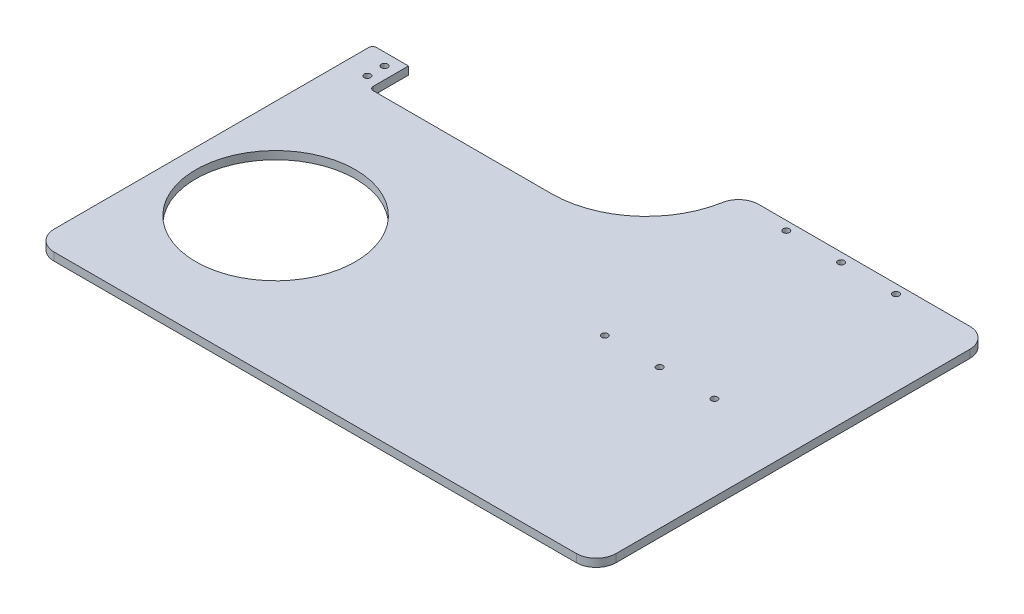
ISO-10303-21;
HEADER;
FILE_DESCRIPTION(('STEP AP214'),'2;1');
FILE_NAME('part.step','',(''),(''),'','','');
FILE_SCHEMA(('AUTOMOTIVE_DESIGN { 1 0 10303 214 1 1 1 1 }'));
ENDSEC;
DATA;
#1=APPLICATION_CONTEXT('core data for automotive mechanical design processes');
#2=APPLICATION_PROTOCOL_DEFINITION('international standard','automotive_design',2000,#1);
#3=PRODUCT_CONTEXT('',#1,'mechanical');
#4=PRODUCT('Part','Part','',(#3));
#5=PRODUCT_RELATED_PRODUCT_CATEGORY('part','',(#4));
#6=PRODUCT_DEFINITION_FORMATION('','',#4);
#7=PRODUCT_DEFINITION_CONTEXT('part definition',#1,'design');
#8=PRODUCT_DEFINITION('design','',#6,#7);
#9=PRODUCT_DEFINITION_SHAPE('','',#8);
#10=(LENGTH_UNIT() NAMED_UNIT(*) SI_UNIT(.MILLI.,.METRE.));
#11=(NAMED_UNIT(*) PLANE_ANGLE_UNIT() SI_UNIT($,.RADIAN.));
#12=(NAMED_UNIT(*) SI_UNIT($,.STERADIAN.) SOLID_ANGLE_UNIT());
#13=UNCERTAINTY_MEASURE_WITH_UNIT(LENGTH_MEASURE(1.E-05),#10,'distance_accuracy_value','');
#14=(GEOMETRIC_REPRESENTATION_CONTEXT(3) GLOBAL_UNCERTAINTY_ASSIGNED_CONTEXT((#13)) GLOBAL_UNIT_ASSIGNED_CONTEXT((#10,
#11,#12)) REPRESENTATION_CONTEXT('',''));
#15=CARTESIAN_POINT('',(0.,0.,0.));
#16=DIRECTION('',(0.,0.,1.));
#17=DIRECTION('',(1.,0.,0.));
#18=AXIS2_PLACEMENT_3D('',#15,#16,#17);
#19=CARTESIAN_POINT('',(0.,0.,0.));
#20=DIRECTION('',(0.,-1.,0.));
#21=DIRECTION('',(0.,0.,-1.));
#22=AXIS2_PLACEMENT_3D('',#19,#20,#21);
#23=PLANE('',#22);
#24=CARTESIAN_POINT('',(0.896230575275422,0.,-14.));
#25=DIRECTION('',(0.,-1.,0.));
#26=DIRECTION('',(0.,0.,-1.));
#27=AXIS2_PLACEMENT_3D('',#24,#25,#26);
#28=CIRCLE('',#27,40.);
#29=CARTESIAN_POINT('',(0.896230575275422,0.,-54.));
#30=VERTEX_POINT('',#29);
#31=EDGE_CURVE('E365',#30,#30,#28,.F.);
#32=ORIENTED_EDGE('',*,*,#31,.T.);
#33=EDGE_LOOP('',(#32));
#34=FACE_BOUND('',#33,.T.);
#35=CARTESIAN_POINT('',(135.415383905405,0.,-44.5));
#36=DIRECTION('',(0.,-1.,0.));
#37=DIRECTION('',(0.,0.,-1.));
#38=AXIS2_PLACEMENT_3D('',#35,#36,#37);
#39=CIRCLE('',#38,1.59999999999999);
#40=CARTESIAN_POINT('',(135.415383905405,0.,-46.1));
#41=VERTEX_POINT('',#40);
#42=EDGE_CURVE('E369',#41,#41,#39,.F.);
#43=ORIENTED_EDGE('',*,*,#42,.T.);
#44=EDGE_LOOP('',(#43));
#45=FACE_BOUND('',#44,.T.);
#46=CARTESIAN_POINT('',(162.915383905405,0.,-44.5));
#47=DIRECTION('',(0.,-1.,0.));
#48=DIRECTION('',(0.,0.,-1.));
#49=AXIS2_PLACEMENT_3D('',#46,#47,#48);
#50=CIRCLE('',#49,1.59999999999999);
#51=CARTESIAN_POINT('',(162.915383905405,0.,-46.1));
#52=VERTEX_POINT('',#51);
#53=EDGE_CURVE('E373',#52,#52,#50,.F.);
#54=ORIENTED_EDGE('',*,*,#53,.T.);
#55=EDGE_LOOP('',(#54));
#56=FACE_BOUND('',#55,.T.);
#57=CARTESIAN_POINT('',(190.415383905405,0.,-44.5));
#58=DIRECTION('',(0.,-1.,0.));
#59=DIRECTION('',(0.,0.,-1.));
#60=AXIS2_PLACEMENT_3D('',#57,#58,#59);
#61=CIRCLE('',#60,1.59999999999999);
#62=CARTESIAN_POINT('',(190.415383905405,0.,-46.1));
#63=VERTEX_POINT('',#62);
#64=EDGE_CURVE('E377',#63,#63,#61,.F.);
#65=ORIENTED_EDGE('',*,*,#64,.T.);
#66=EDGE_LOOP('',(#65));
#67=FACE_BOUND('',#66,.T.);
#68=CARTESIAN_POINT('',(190.415383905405,0.,-135.5));
#69=DIRECTION('',(0.,-1.,0.));
#70=DIRECTION('',(0.,0.,-1.));
#71=AXIS2_PLACEMENT_3D('',#68,#69,#70);
#72=CIRCLE('',#71,1.59999999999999);
#73=CARTESIAN_POINT('',(190.415383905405,0.,-137.1));
#74=VERTEX_POINT('',#73);
#75=EDGE_CURVE('E381',#74,#74,#72,.F.);
#76=ORIENTED_EDGE('',*,*,#75,.T.);
#77=EDGE_LOOP('',(#76));
#78=FACE_BOUND('',#77,.T.);
#79=CARTESIAN_POINT('',(162.915383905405,0.,-135.5));
#80=DIRECTION('',(0.,-1.,0.));
#81=DIRECTION('',(0.,0.,-1.));
#82=AXIS2_PLACEMENT_3D('',#79,#80,#81);
#83=CIRCLE('',#82,1.59999999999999);
#84=CARTESIAN_POINT('',(162.915383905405,0.,-137.1));
#85=VERTEX_POINT('',#84);
#86=EDGE_CURVE('E385',#85,#85,#83,.F.);
#87=ORIENTED_EDGE('',*,*,#86,.T.);
#88=EDGE_LOOP('',(#87));
#89=FACE_BOUND('',#88,.T.);
#90=CARTESIAN_POINT('',(135.415383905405,0.,-135.5));
#91=DIRECTION('',(0.,-1.,0.));
#92=DIRECTION('',(0.,0.,-1.));
#93=AXIS2_PLACEMENT_3D('',#90,#91,#92);
#94=CIRCLE('',#93,1.59999999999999);
#95=CARTESIAN_POINT('',(135.415383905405,0.,-137.1));
#96=VERTEX_POINT('',#95);
#97=EDGE_CURVE('E389',#96,#96,#94,.F.);
#98=ORIENTED_EDGE('',*,*,#97,.T.);
#99=EDGE_LOOP('',(#98));
#100=FACE_BOUND('',#99,.T.);
#101=CARTESIAN_POINT('',(-36.8037694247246,0.,-97.7206100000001));
#102=DIRECTION('',(0.,-1.,0.));
#103=DIRECTION('',(0.,0.,-1.));
#104=AXIS2_PLACEMENT_3D('',#101,#102,#103);
#105=CIRCLE('',#104,1.6);
#106=CARTESIAN_POINT('',(-36.8037694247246,0.,-99.3206100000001));
#107=VERTEX_POINT('',#106);
#108=EDGE_CURVE('E393',#107,#107,#105,.F.);
#109=ORIENTED_EDGE('',*,*,#108,.T.);
#110=EDGE_LOOP('',(#109));
#111=FACE_BOUND('',#110,.T.);
#112=CARTESIAN_POINT('',(-36.8037694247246,0.,-106.32061));
#113=DIRECTION('',(0.,-1.,0.));
#114=DIRECTION('',(0.,0.,-1.));
#115=AXIS2_PLACEMENT_3D('',#112,#113,#114);
#116=CIRCLE('',#115,1.6);
#117=CARTESIAN_POINT('',(-36.8037694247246,0.,-107.92061));
#118=VERTEX_POINT('',#117);
#119=EDGE_CURVE('E208',#118,#118,#116,.F.);
#120=ORIENTED_EDGE('',*,*,#119,.T.);
#121=EDGE_LOOP('',(#120));
#122=FACE_BOUND('',#121,.T.);
#123=CARTESIAN_POINT('',(-38.8037694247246,0.,47.2949));
#124=DIRECTION('',(0.,-1.,0.));
#125=DIRECTION('',(0.,0.,-1.));
#126=AXIS2_PLACEMENT_3D('',#123,#124,#125);
#127=CIRCLE('',#126,10.);
#128=CARTESIAN_POINT('',(-38.8037694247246,0.,57.2949));
#129=VERTEX_POINT('',#128);
#130=CARTESIAN_POINT('',(-48.8037694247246,0.,47.2949));
#131=VERTEX_POINT('',#130);
#132=EDGE_CURVE('E109',#129,#131,#127,.T.);
#133=ORIENTED_EDGE('',*,*,#132,.T.);
#134=DIRECTION('',(0.,0.,-1.));
#135=VECTOR('',#134,1.);
#136=CARTESIAN_POINT('',(-48.8037694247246,0.,47.2949));
#137=LINE('',#136,#135);
#138=CARTESIAN_POINT('',(-48.8037694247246,0.,-110.32061));
#139=VERTEX_POINT('',#138);
#140=EDGE_CURVE('E192',#131,#139,#137,.T.);
#141=ORIENTED_EDGE('',*,*,#140,.T.);
#142=CARTESIAN_POINT('',(-46.8037694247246,0.,-110.32061));
#143=DIRECTION('',(0.,1.,0.));
#144=DIRECTION('',(0.,0.,1.));
#145=AXIS2_PLACEMENT_3D('',#142,#143,#144);
#146=CIRCLE('',#145,2.);
#147=CARTESIAN_POINT('',(-46.8037694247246,0.,-112.32061));
#148=VERTEX_POINT('',#147);
#149=EDGE_CURVE('E197',#148,#139,#146,.T.);
#150=ORIENTED_EDGE('',*,*,#149,.F.);
#151=DIRECTION('',(1.,0.,0.));
#152=VECTOR('',#151,1.);
#153=CARTESIAN_POINT('',(-46.8037694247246,0.,-112.32061));
#154=LINE('',#153,#152);
#155=CARTESIAN_POINT('',(-30.8037694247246,0.,-112.32061));
#156=VERTEX_POINT('',#155);
#157=EDGE_CURVE('E212',#148,#156,#154,.T.);
#158=ORIENTED_EDGE('',*,*,#157,.T.);
#159=DIRECTION('',(0.,0.,1.));
#160=VECTOR('',#159,1.);
#161=CARTESIAN_POINT('',(-30.8037694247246,0.,-112.32061));
#162=LINE('',#161,#160);
#163=CARTESIAN_POINT('',(-30.8037694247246,0.,-94.7051));
#164=VERTEX_POINT('',#163);
#165=EDGE_CURVE('E215',#156,#164,#162,.T.);
#166=ORIENTED_EDGE('',*,*,#165,.T.);
#167=CARTESIAN_POINT('',(-28.8037694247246,0.,-94.7051));
#168=DIRECTION('',(0.,1.,0.));
#169=DIRECTION('',(0.,0.,1.));
#170=AXIS2_PLACEMENT_3D('',#167,#168,#169);
#171=CIRCLE('',#170,2.);
#172=CARTESIAN_POINT('',(-28.8037694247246,0.,-92.7051));
#173=VERTEX_POINT('',#172);
#174=EDGE_CURVE('E218',#164,#173,#171,.T.);
#175=ORIENTED_EDGE('',*,*,#174,.T.);
#176=DIRECTION('',(1.,0.,0.));
#177=VECTOR('',#176,1.);
#178=CARTESIAN_POINT('',(-28.8037694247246,0.,-92.7051));
#179=LINE('',#178,#177);
#180=CARTESIAN_POINT('',(60.6204839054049,0.,-92.7051));
#181=VERTEX_POINT('',#180);
#182=EDGE_CURVE('E221',#173,#181,#179,.T.);
#183=ORIENTED_EDGE('',*,*,#182,.T.);
#184=CARTESIAN_POINT('',(60.6204839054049,0.,-140.));
#185=DIRECTION('',(0.,1.,0.));
#186=DIRECTION('',(0.,0.,1.));
#187=AXIS2_PLACEMENT_3D('',#184,#185,#186);
#188=CIRCLE('',#187,47.2949);
#189=CARTESIAN_POINT('',(107.189448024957,0.,-131.745356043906));
#190=VERTEX_POINT('',#189);
#191=EDGE_CURVE('E224',#181,#190,#188,.T.);
#192=ORIENTED_EDGE('',*,*,#191,.T.);
#193=CARTESIAN_POINT('',(117.035956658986,0.,-130.));
#194=DIRECTION('',(0.,-1.,0.));
#195=DIRECTION('',(0.,0.,-1.));
#196=AXIS2_PLACEMENT_3D('',#193,#194,#195);
#197=CIRCLE('',#196,10.);
#198=CARTESIAN_POINT('',(117.035956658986,0.,-140.));
#199=VERTEX_POINT('',#198);
#200=EDGE_CURVE('E227',#190,#199,#197,.T.);
#201=ORIENTED_EDGE('',*,*,#200,.T.);
#202=DIRECTION('',(1.,0.,0.));
#203=VECTOR('',#202,1.);
#204=CARTESIAN_POINT('',(117.035956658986,0.,-140.));
#205=LINE('',#204,#203);
#206=CARTESIAN_POINT('',(222.915383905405,0.,-140.));
#207=VERTEX_POINT('',#206);
#208=EDGE_CURVE('E230',#199,#207,#205,.T.);
#209=ORIENTED_EDGE('',*,*,#208,.T.);
#210=CARTESIAN_POINT('',(222.915383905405,0.,-130.));
#211=DIRECTION('',(0.,-1.,0.));
#212=DIRECTION('',(0.,0.,-1.));
#213=AXIS2_PLACEMENT_3D('',#210,#211,#212);
#214=CIRCLE('',#213,10.);
#215=CARTESIAN_POINT('',(232.915383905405,0.,-130.));
#216=VERTEX_POINT('',#215);
#217=EDGE_CURVE('E233',#207,#216,#214,.T.);
#218=ORIENTED_EDGE('',*,*,#217,.T.);
#219=DIRECTION('',(0.,0.,1.));
#220=VECTOR('',#219,1.);
#221=CARTESIAN_POINT('',(232.915383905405,0.,-130.));
#222=LINE('',#221,#220);
#223=CARTESIAN_POINT('',(232.915383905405,0.,47.2949));
#224=VERTEX_POINT('',#223);
#225=EDGE_CURVE('E236',#216,#224,#222,.T.);
#226=ORIENTED_EDGE('',*,*,#225,.T.);
#227=CARTESIAN_POINT('',(222.915383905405,0.,47.2949));
#228=DIRECTION('',(0.,-1.,0.));
#229=DIRECTION('',(0.,0.,-1.));
#230=AXIS2_PLACEMENT_3D('',#227,#228,#229);
#231=CIRCLE('',#230,10.);
#232=CARTESIAN_POINT('',(222.915383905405,0.,57.2949));
#233=VERTEX_POINT('',#232);
#234=EDGE_CURVE('E239',#224,#233,#231,.T.);
#235=ORIENTED_EDGE('',*,*,#234,.T.);
#236=DIRECTION('',(-1.,0.,0.));
#237=VECTOR('',#236,1.);
#238=CARTESIAN_POINT('',(222.915383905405,0.,57.2949));
#239=LINE('',#238,#237);
#240=EDGE_CURVE('E202',#233,#129,#239,.T.);
#241=ORIENTED_EDGE('',*,*,#240,.T.);
#242=EDGE_LOOP('',(#133,#141,#150,#158,#166,#175,#183,#192,#201,#209,#218,#226,#235,#241));
#243=FACE_BOUND('',#242,.T.);
#244=ADVANCED_FACE('F87',(#34,#45,#56,#67,#78,#89,#100,#111,#122,#243),#23,.T.);
#245=CARTESIAN_POINT('',(-38.8037694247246,0.,47.2949));
#246=DIRECTION('',(0.,1.,0.));
#247=DIRECTION('',(0.,0.,1.));
#248=AXIS2_PLACEMENT_3D('',#245,#246,#247);
#249=CYLINDRICAL_SURFACE('',#248,10.);
#250=CARTESIAN_POINT('',(-38.8037694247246,4.,47.2949));
#251=DIRECTION('',(0.,-1.,0.));
#252=DIRECTION('',(0.,0.,-1.));
#253=AXIS2_PLACEMENT_3D('',#250,#251,#252);
#254=CIRCLE('',#253,10.);
#255=CARTESIAN_POINT('',(-38.8037694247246,4.,57.2949));
#256=VERTEX_POINT('',#255);
#257=CARTESIAN_POINT('',(-48.8037694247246,4.,47.2949));
#258=VERTEX_POINT('',#257);
#259=EDGE_CURVE('E187',#256,#258,#254,.T.);
#260=ORIENTED_EDGE('',*,*,#259,.T.);
#261=DIRECTION('',(0.,1.,0.));
#262=VECTOR('',#261,1.);
#263=CARTESIAN_POINT('',(-48.8037694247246,0.,47.2949));
#264=LINE('',#263,#262);
#265=EDGE_CURVE('E12',#131,#258,#264,.T.);
#266=ORIENTED_EDGE('',*,*,#265,.F.);
#267=ORIENTED_EDGE('',*,*,#132,.F.);
#268=DIRECTION('',(0.,1.,0.));
#269=VECTOR('',#268,1.);
#270=CARTESIAN_POINT('',(-38.8037694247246,0.,57.2949));
#271=LINE('',#270,#269);
#272=EDGE_CURVE('E242',#129,#256,#271,.T.);
#273=ORIENTED_EDGE('',*,*,#272,.T.);
#274=EDGE_LOOP('',(#260,#266,#267,#273));
#275=FACE_BOUND('',#274,.T.);
#276=ADVANCED_FACE('F185',(#275),#249,.T.);
#277=CARTESIAN_POINT('',(-48.8037694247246,0.,47.2949));
#278=DIRECTION('',(1.,0.,0.));
#279=DIRECTION('',(0.,0.,-1.));
#280=AXIS2_PLACEMENT_3D('',#277,#278,#279);
#281=PLANE('',#280);
#282=DIRECTION('',(0.,0.,-1.));
#283=VECTOR('',#282,1.);
#284=CARTESIAN_POINT('',(-48.8037694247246,4.,47.2949));
#285=LINE('',#284,#283);
#286=CARTESIAN_POINT('',(-48.8037694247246,4.,-110.32061));
#287=VERTEX_POINT('',#286);
#288=EDGE_CURVE('E244',#258,#287,#285,.T.);
#289=ORIENTED_EDGE('',*,*,#288,.T.);
#290=DIRECTION('',(0.,1.,0.));
#291=VECTOR('',#290,1.);
#292=CARTESIAN_POINT('',(-48.8037694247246,0.,-110.32061));
#293=LINE('',#292,#291);
#294=EDGE_CURVE('E94',#139,#287,#293,.T.);
#295=ORIENTED_EDGE('',*,*,#294,.F.);
#296=ORIENTED_EDGE('',*,*,#140,.F.);
#297=ORIENTED_EDGE('',*,*,#265,.T.);
#298=EDGE_LOOP('',(#289,#295,#296,#297));
#299=FACE_BOUND('',#298,.T.);
#300=ADVANCED_FACE('F193',(#299),#281,.F.);
#301=CARTESIAN_POINT('',(-46.8037694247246,0.,-110.32061));
#302=DIRECTION('',(0.,1.,0.));
#303=DIRECTION('',(0.,0.,1.));
#304=AXIS2_PLACEMENT_3D('',#301,#302,#303);
#305=CYLINDRICAL_SURFACE('',#304,2.);
#306=CARTESIAN_POINT('',(-46.8037694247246,4.,-110.32061));
#307=DIRECTION('',(0.,1.,0.));
#308=DIRECTION('',(0.,0.,1.));
#309=AXIS2_PLACEMENT_3D('',#306,#307,#308);
#310=CIRCLE('',#309,2.);
#311=CARTESIAN_POINT('',(-46.8037694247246,4.,-112.32061));
#312=VERTEX_POINT('',#311);
#313=EDGE_CURVE('E247',#312,#287,#310,.T.);
#314=ORIENTED_EDGE('',*,*,#313,.F.);
#315=DIRECTION('',(0.,1.,0.));
#316=VECTOR('',#315,1.);
#317=CARTESIAN_POINT('',(-46.8037694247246,0.,-112.32061));
#318=LINE('',#317,#316);
#319=EDGE_CURVE('E299',#148,#312,#318,.T.);
#320=ORIENTED_EDGE('',*,*,#319,.F.);
#321=ORIENTED_EDGE('',*,*,#149,.T.);
#322=ORIENTED_EDGE('',*,*,#294,.T.);
#323=EDGE_LOOP('',(#314,#320,#321,#322));
#324=FACE_BOUND('',#323,.T.);
#325=ADVANCED_FACE('F302',(#324),#305,.T.);
#326=CARTESIAN_POINT('',(-46.8037694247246,0.,-112.32061));
#327=DIRECTION('',(0.,0.,1.));
#328=DIRECTION('',(1.,0.,0.));
#329=AXIS2_PLACEMENT_3D('',#326,#327,#328);
#330=PLANE('',#329);
#331=DIRECTION('',(1.,0.,0.));
#332=VECTOR('',#331,1.);
#333=CARTESIAN_POINT('',(-46.8037694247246,4.,-112.32061));
#334=LINE('',#333,#332);
#335=CARTESIAN_POINT('',(-30.8037694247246,4.,-112.32061));
#336=VERTEX_POINT('',#335);
#337=EDGE_CURVE('E250',#312,#336,#334,.T.);
#338=ORIENTED_EDGE('',*,*,#337,.T.);
#339=DIRECTION('',(0.,1.,0.));
#340=VECTOR('',#339,1.);
#341=CARTESIAN_POINT('',(-30.8037694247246,0.,-112.32061));
#342=LINE('',#341,#340);
#343=EDGE_CURVE('E297',#156,#336,#342,.T.);
#344=ORIENTED_EDGE('',*,*,#343,.F.);
#345=ORIENTED_EDGE('',*,*,#157,.F.);
#346=ORIENTED_EDGE('',*,*,#319,.T.);
#347=EDGE_LOOP('',(#338,#344,#345,#346));
#348=FACE_BOUND('',#347,.T.);
#349=ADVANCED_FACE('F309',(#348),#330,.F.);
#350=CARTESIAN_POINT('',(-30.8037694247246,0.,-112.32061));
#351=DIRECTION('',(-1.,0.,0.));
#352=DIRECTION('',(0.,0.,1.));
#353=AXIS2_PLACEMENT_3D('',#350,#351,#352);
#354=PLANE('',#353);
#355=DIRECTION('',(0.,0.,1.));
#356=VECTOR('',#355,1.);
#357=CARTESIAN_POINT('',(-30.8037694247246,4.,-112.32061));
#358=LINE('',#357,#356);
#359=CARTESIAN_POINT('',(-30.8037694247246,4.,-94.7051));
#360=VERTEX_POINT('',#359);
#361=EDGE_CURVE('E253',#336,#360,#358,.T.);
#362=ORIENTED_EDGE('',*,*,#361,.T.);
#363=DIRECTION('',(0.,1.,0.));
#364=VECTOR('',#363,1.);
#365=CARTESIAN_POINT('',(-30.8037694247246,0.,-94.7051));
#366=LINE('',#365,#364);
#367=EDGE_CURVE('E295',#164,#360,#366,.T.);
#368=ORIENTED_EDGE('',*,*,#367,.F.);
#369=ORIENTED_EDGE('',*,*,#165,.F.);
#370=ORIENTED_EDGE('',*,*,#343,.T.);
#371=EDGE_LOOP('',(#362,#368,#369,#370));
#372=FACE_BOUND('',#371,.T.);
#373=ADVANCED_FACE('F314',(#372),#354,.F.);
#374=CARTESIAN_POINT('',(-28.8037694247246,0.,-94.7051));
#375=DIRECTION('',(0.,1.,0.));
#376=DIRECTION('',(0.,0.,1.));
#377=AXIS2_PLACEMENT_3D('',#374,#375,#376);
#378=CYLINDRICAL_SURFACE('',#377,2.);
#379=CARTESIAN_POINT('',(-28.8037694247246,4.,-94.7051));
#380=DIRECTION('',(0.,1.,0.));
#381=DIRECTION('',(0.,0.,1.));
#382=AXIS2_PLACEMENT_3D('',#379,#380,#381);
#383=CIRCLE('',#382,2.);
#384=CARTESIAN_POINT('',(-28.8037694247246,4.,-92.7051));
#385=VERTEX_POINT('',#384);
#386=EDGE_CURVE('E256',#360,#385,#383,.T.);
#387=ORIENTED_EDGE('',*,*,#386,.T.);
#388=DIRECTION('',(0.,1.,0.));
#389=VECTOR('',#388,1.);
#390=CARTESIAN_POINT('',(-28.8037694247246,0.,-92.7051));
#391=LINE('',#390,#389);
#392=EDGE_CURVE('E293',#173,#385,#391,.T.);
#393=ORIENTED_EDGE('',*,*,#392,.F.);
#394=ORIENTED_EDGE('',*,*,#174,.F.);
#395=ORIENTED_EDGE('',*,*,#367,.T.);
#396=EDGE_LOOP('',(#387,#393,#394,#395));
#397=FACE_BOUND('',#396,.T.);
#398=ADVANCED_FACE('F316',(#397),#378,.F.);
#399=CARTESIAN_POINT('',(-28.8037694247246,0.,-92.7051));
#400=DIRECTION('',(0.,0.,1.));
#401=DIRECTION('',(1.,0.,0.));
#402=AXIS2_PLACEMENT_3D('',#399,#400,#401);
#403=PLANE('',#402);
#404=DIRECTION('',(1.,0.,0.));
#405=VECTOR('',#404,1.);
#406=CARTESIAN_POINT('',(-28.8037694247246,4.,-92.7051));
#407=LINE('',#406,#405);
#408=CARTESIAN_POINT('',(60.6204839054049,4.,-92.7051));
#409=VERTEX_POINT('',#408);
#410=EDGE_CURVE('E259',#385,#409,#407,.T.);
#411=ORIENTED_EDGE('',*,*,#410,.T.);
#412=DIRECTION('',(0.,1.,0.));
#413=VECTOR('',#412,1.);
#414=CARTESIAN_POINT('',(60.6204839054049,0.,-92.7051));
#415=LINE('',#414,#413);
#416=EDGE_CURVE('E291',#181,#409,#415,.T.);
#417=ORIENTED_EDGE('',*,*,#416,.F.);
#418=ORIENTED_EDGE('',*,*,#182,.F.);
#419=ORIENTED_EDGE('',*,*,#392,.T.);
#420=EDGE_LOOP('',(#411,#417,#418,#419));
#421=FACE_BOUND('',#420,.T.);
#422=ADVANCED_FACE('F320',(#421),#403,.F.);
#423=CARTESIAN_POINT('',(60.6204839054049,0.,-140.));
#424=DIRECTION('',(0.,1.,0.));
#425=DIRECTION('',(0.,0.,1.));
#426=AXIS2_PLACEMENT_3D('',#423,#424,#425);
#427=CYLINDRICAL_SURFACE('',#426,47.2949);
#428=CARTESIAN_POINT('',(60.6204839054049,4.,-140.));
#429=DIRECTION('',(0.,1.,0.));
#430=DIRECTION('',(0.,0.,1.));
#431=AXIS2_PLACEMENT_3D('',#428,#429,#430);
#432=CIRCLE('',#431,47.2949);
#433=CARTESIAN_POINT('',(107.189448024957,4.,-131.745356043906));
#434=VERTEX_POINT('',#433);
#435=EDGE_CURVE('E262',#409,#434,#432,.T.);
#436=ORIENTED_EDGE('',*,*,#435,.T.);
#437=DIRECTION('',(0.,1.,0.));
#438=VECTOR('',#437,1.);
#439=CARTESIAN_POINT('',(107.189448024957,0.,-131.745356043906));
#440=LINE('',#439,#438);
#441=EDGE_CURVE('E289',#190,#434,#440,.T.);
#442=ORIENTED_EDGE('',*,*,#441,.F.);
#443=ORIENTED_EDGE('',*,*,#191,.F.);
#444=ORIENTED_EDGE('',*,*,#416,.T.);
#445=EDGE_LOOP('',(#436,#442,#443,#444));
#446=FACE_BOUND('',#445,.T.);
#447=ADVANCED_FACE('F324',(#446),#427,.F.);
#448=CARTESIAN_POINT('',(117.035956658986,0.,-130.));
#449=DIRECTION('',(0.,1.,0.));
#450=DIRECTION('',(0.,0.,1.));
#451=AXIS2_PLACEMENT_3D('',#448,#449,#450);
#452=CYLINDRICAL_SURFACE('',#451,10.);
#453=CARTESIAN_POINT('',(117.035956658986,4.,-130.));
#454=DIRECTION('',(0.,-1.,0.));
#455=DIRECTION('',(0.,0.,-1.));
#456=AXIS2_PLACEMENT_3D('',#453,#454,#455);
#457=CIRCLE('',#456,10.);
#458=CARTESIAN_POINT('',(117.035956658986,4.,-140.));
#459=VERTEX_POINT('',#458);
#460=EDGE_CURVE('E265',#434,#459,#457,.T.);
#461=ORIENTED_EDGE('',*,*,#460,.T.);
#462=DIRECTION('',(0.,1.,0.));
#463=VECTOR('',#462,1.);
#464=CARTESIAN_POINT('',(117.035956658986,0.,-140.));
#465=LINE('',#464,#463);
#466=EDGE_CURVE('E287',#199,#459,#465,.T.);
#467=ORIENTED_EDGE('',*,*,#466,.F.);
#468=ORIENTED_EDGE('',*,*,#200,.F.);
#469=ORIENTED_EDGE('',*,*,#441,.T.);
#470=EDGE_LOOP('',(#461,#467,#468,#469));
#471=FACE_BOUND('',#470,.T.);
#472=ADVANCED_FACE('F328',(#471),#452,.T.);
#473=CARTESIAN_POINT('',(117.035956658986,0.,-140.));
#474=DIRECTION('',(0.,0.,1.));
#475=DIRECTION('',(1.,0.,0.));
#476=AXIS2_PLACEMENT_3D('',#473,#474,#475);
#477=PLANE('',#476);
#478=DIRECTION('',(1.,0.,0.));
#479=VECTOR('',#478,1.);
#480=CARTESIAN_POINT('',(117.035956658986,4.,-140.));
#481=LINE('',#480,#479);
#482=CARTESIAN_POINT('',(222.915383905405,4.,-140.));
#483=VERTEX_POINT('',#482);
#484=EDGE_CURVE('E268',#459,#483,#481,.T.);
#485=ORIENTED_EDGE('',*,*,#484,.T.);
#486=DIRECTION('',(0.,1.,0.));
#487=VECTOR('',#486,1.);
#488=CARTESIAN_POINT('',(222.915383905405,0.,-140.));
#489=LINE('',#488,#487);
#490=EDGE_CURVE('E285',#207,#483,#489,.T.);
#491=ORIENTED_EDGE('',*,*,#490,.F.);
#492=ORIENTED_EDGE('',*,*,#208,.F.);
#493=ORIENTED_EDGE('',*,*,#466,.T.);
#494=EDGE_LOOP('',(#485,#491,#492,#493));
#495=FACE_BOUND('',#494,.T.);
#496=ADVANCED_FACE('F332',(#495),#477,.F.);
#497=CARTESIAN_POINT('',(222.915383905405,0.,-130.));
#498=DIRECTION('',(0.,1.,0.));
#499=DIRECTION('',(0.,0.,1.));
#500=AXIS2_PLACEMENT_3D('',#497,#498,#499);
#501=CYLINDRICAL_SURFACE('',#500,10.);
#502=CARTESIAN_POINT('',(222.915383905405,4.,-130.));
#503=DIRECTION('',(0.,-1.,0.));
#504=DIRECTION('',(0.,0.,-1.));
#505=AXIS2_PLACEMENT_3D('',#502,#503,#504);
#506=CIRCLE('',#505,10.);
#507=CARTESIAN_POINT('',(232.915383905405,4.,-130.));
#508=VERTEX_POINT('',#507);
#509=EDGE_CURVE('E271',#483,#508,#506,.T.);
#510=ORIENTED_EDGE('',*,*,#509,.T.);
#511=DIRECTION('',(0.,1.,0.));
#512=VECTOR('',#511,1.);
#513=CARTESIAN_POINT('',(232.915383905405,0.,-130.));
#514=LINE('',#513,#512);
#515=EDGE_CURVE('E283',#216,#508,#514,.T.);
#516=ORIENTED_EDGE('',*,*,#515,.F.);
#517=ORIENTED_EDGE('',*,*,#217,.F.);
#518=ORIENTED_EDGE('',*,*,#490,.T.);
#519=EDGE_LOOP('',(#510,#516,#517,#518));
#520=FACE_BOUND('',#519,.T.);
#521=ADVANCED_FACE('F336',(#520),#501,.T.);
#522=CARTESIAN_POINT('',(232.915383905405,0.,-130.));
#523=DIRECTION('',(-1.,0.,0.));
#524=DIRECTION('',(0.,0.,1.));
#525=AXIS2_PLACEMENT_3D('',#522,#523,#524);
#526=PLANE('',#525);
#527=DIRECTION('',(0.,0.,1.));
#528=VECTOR('',#527,1.);
#529=CARTESIAN_POINT('',(232.915383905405,4.,-130.));
#530=LINE('',#529,#528);
#531=CARTESIAN_POINT('',(232.915383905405,4.,47.2949));
#532=VERTEX_POINT('',#531);
#533=EDGE_CURVE('E274',#508,#532,#530,.T.);
#534=ORIENTED_EDGE('',*,*,#533,.T.);
#535=DIRECTION('',(0.,1.,0.));
#536=VECTOR('',#535,1.);
#537=CARTESIAN_POINT('',(232.915383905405,0.,47.2949));
#538=LINE('',#537,#536);
#539=EDGE_CURVE('E281',#224,#532,#538,.T.);
#540=ORIENTED_EDGE('',*,*,#539,.F.);
#541=ORIENTED_EDGE('',*,*,#225,.F.);
#542=ORIENTED_EDGE('',*,*,#515,.T.);
#543=EDGE_LOOP('',(#534,#540,#541,#542));
#544=FACE_BOUND('',#543,.T.);
#545=ADVANCED_FACE('F340',(#544),#526,.F.);
#546=CARTESIAN_POINT('',(222.915383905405,0.,47.2949));
#547=DIRECTION('',(0.,1.,0.));
#548=DIRECTION('',(0.,0.,1.));
#549=AXIS2_PLACEMENT_3D('',#546,#547,#548);
#550=CYLINDRICAL_SURFACE('',#549,10.);
#551=CARTESIAN_POINT('',(222.915383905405,4.,47.2949));
#552=DIRECTION('',(0.,-1.,0.));
#553=DIRECTION('',(0.,0.,-1.));
#554=AXIS2_PLACEMENT_3D('',#551,#552,#553);
#555=CIRCLE('',#554,10.);
#556=CARTESIAN_POINT('',(222.915383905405,4.,57.2949));
#557=VERTEX_POINT('',#556);
#558=EDGE_CURVE('E101',#532,#557,#555,.T.);
#559=ORIENTED_EDGE('',*,*,#558,.T.);
#560=DIRECTION('',(0.,1.,0.));
#561=VECTOR('',#560,1.);
#562=CARTESIAN_POINT('',(222.915383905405,0.,57.2949));
#563=LINE('',#562,#561);
#564=EDGE_CURVE('E279',#233,#557,#563,.T.);
#565=ORIENTED_EDGE('',*,*,#564,.F.);
#566=ORIENTED_EDGE('',*,*,#234,.F.);
#567=ORIENTED_EDGE('',*,*,#539,.T.);
#568=EDGE_LOOP('',(#559,#565,#566,#567));
#569=FACE_BOUND('',#568,.T.);
#570=ADVANCED_FACE('F342',(#569),#550,.T.);
#571=CARTESIAN_POINT('',(222.915383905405,0.,57.2949));
#572=DIRECTION('',(0.,0.,-1.));
#573=DIRECTION('',(-1.,0.,0.));
#574=AXIS2_PLACEMENT_3D('',#571,#572,#573);
#575=PLANE('',#574);
#576=DIRECTION('',(-1.,0.,0.));
#577=VECTOR('',#576,1.);
#578=CARTESIAN_POINT('',(222.915383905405,4.,57.2949));
#579=LINE('',#578,#577);
#580=EDGE_CURVE('E203',#557,#256,#579,.T.);
#581=ORIENTED_EDGE('',*,*,#580,.T.);
#582=ORIENTED_EDGE('',*,*,#272,.F.);
#583=ORIENTED_EDGE('',*,*,#240,.F.);
#584=ORIENTED_EDGE('',*,*,#564,.T.);
#585=EDGE_LOOP('',(#581,#582,#583,#584));
#586=FACE_BOUND('',#585,.T.);
#587=ADVANCED_FACE('F345',(#586),#575,.F.);
#588=CARTESIAN_POINT('',(0.,4.,0.));
#589=DIRECTION('',(0.,-1.,0.));
#590=DIRECTION('',(0.,0.,-1.));
#591=AXIS2_PLACEMENT_3D('',#588,#589,#590);
#592=PLANE('',#591);
#593=CARTESIAN_POINT('',(0.896230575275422,4.,-14.));
#594=DIRECTION('',(0.,1.,0.));
#595=DIRECTION('',(0.,0.,1.));
#596=AXIS2_PLACEMENT_3D('',#593,#594,#595);
#597=CIRCLE('',#596,40.);
#598=CARTESIAN_POINT('',(0.896230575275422,4.,26.));
#599=VERTEX_POINT('',#598);
#600=EDGE_CURVE('E429',#599,#599,#597,.T.);
#601=ORIENTED_EDGE('',*,*,#600,.F.);
#602=EDGE_LOOP('',(#601));
#603=FACE_BOUND('',#602,.T.);
#604=CARTESIAN_POINT('',(135.415383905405,4.,-44.5));
#605=DIRECTION('',(0.,1.,0.));
#606=DIRECTION('',(0.,0.,1.));
#607=AXIS2_PLACEMENT_3D('',#604,#605,#606);
#608=CIRCLE('',#607,1.59999999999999);
#609=CARTESIAN_POINT('',(135.415383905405,4.,-42.9));
#610=VERTEX_POINT('',#609);
#611=EDGE_CURVE('E425',#610,#610,#608,.T.);
#612=ORIENTED_EDGE('',*,*,#611,.F.);
#613=EDGE_LOOP('',(#612));
#614=FACE_BOUND('',#613,.T.);
#615=CARTESIAN_POINT('',(162.915383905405,4.,-44.5));
#616=DIRECTION('',(0.,1.,0.));
#617=DIRECTION('',(0.,0.,1.));
#618=AXIS2_PLACEMENT_3D('',#615,#616,#617);
#619=CIRCLE('',#618,1.59999999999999);
#620=CARTESIAN_POINT('',(162.915383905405,4.,-42.9));
#621=VERTEX_POINT('',#620);
#622=EDGE_CURVE('E421',#621,#621,#619,.T.);
#623=ORIENTED_EDGE('',*,*,#622,.F.);
#624=EDGE_LOOP('',(#623));
#625=FACE_BOUND('',#624,.T.);
#626=CARTESIAN_POINT('',(190.415383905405,4.,-44.5));
#627=DIRECTION('',(0.,1.,0.));
#628=DIRECTION('',(0.,0.,1.));
#629=AXIS2_PLACEMENT_3D('',#626,#627,#628);
#630=CIRCLE('',#629,1.59999999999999);
#631=CARTESIAN_POINT('',(190.415383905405,4.,-42.9));
#632=VERTEX_POINT('',#631);
#633=EDGE_CURVE('E417',#632,#632,#630,.T.);
#634=ORIENTED_EDGE('',*,*,#633,.F.);
#635=EDGE_LOOP('',(#634));
#636=FACE_BOUND('',#635,.T.);
#637=CARTESIAN_POINT('',(190.415383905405,4.,-135.5));
#638=DIRECTION('',(0.,1.,0.));
#639=DIRECTION('',(0.,0.,1.));
#640=AXIS2_PLACEMENT_3D('',#637,#638,#639);
#641=CIRCLE('',#640,1.59999999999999);
#642=CARTESIAN_POINT('',(190.415383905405,4.,-133.9));
#643=VERTEX_POINT('',#642);
#644=EDGE_CURVE('E413',#643,#643,#641,.T.);
#645=ORIENTED_EDGE('',*,*,#644,.F.);
#646=EDGE_LOOP('',(#645));
#647=FACE_BOUND('',#646,.T.);
#648=CARTESIAN_POINT('',(162.915383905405,4.,-135.5));
#649=DIRECTION('',(0.,1.,0.));
#650=DIRECTION('',(0.,0.,1.));
#651=AXIS2_PLACEMENT_3D('',#648,#649,#650);
#652=CIRCLE('',#651,1.59999999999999);
#653=CARTESIAN_POINT('',(162.915383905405,4.,-133.9));
#654=VERTEX_POINT('',#653);
#655=EDGE_CURVE('E409',#654,#654,#652,.T.);
#656=ORIENTED_EDGE('',*,*,#655,.F.);
#657=EDGE_LOOP('',(#656));
#658=FACE_BOUND('',#657,.T.);
#659=CARTESIAN_POINT('',(135.415383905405,4.,-135.5));
#660=DIRECTION('',(0.,1.,0.));
#661=DIRECTION('',(0.,0.,1.));
#662=AXIS2_PLACEMENT_3D('',#659,#660,#661);
#663=CIRCLE('',#662,1.59999999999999);
#664=CARTESIAN_POINT('',(135.415383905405,4.,-133.9));
#665=VERTEX_POINT('',#664);
#666=EDGE_CURVE('E403',#665,#665,#663,.T.);
#667=ORIENTED_EDGE('',*,*,#666,.F.);
#668=EDGE_LOOP('',(#667));
#669=FACE_BOUND('',#668,.T.);
#670=CARTESIAN_POINT('',(-36.8037694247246,4.,-97.7206100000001));
#671=DIRECTION('',(0.,1.,0.));
#672=DIRECTION('',(0.,0.,1.));
#673=AXIS2_PLACEMENT_3D('',#670,#671,#672);
#674=CIRCLE('',#673,1.6);
#675=CARTESIAN_POINT('',(-36.8037694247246,4.,-96.1206100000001));
#676=VERTEX_POINT('',#675);
#677=EDGE_CURVE('E397',#676,#676,#674,.T.);
#678=ORIENTED_EDGE('',*,*,#677,.F.);
#679=EDGE_LOOP('',(#678));
#680=FACE_BOUND('',#679,.T.);
#681=CARTESIAN_POINT('',(-36.8037694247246,4.,-106.32061));
#682=DIRECTION('',(0.,1.,0.));
#683=DIRECTION('',(0.,0.,1.));
#684=AXIS2_PLACEMENT_3D('',#681,#682,#683);
#685=CIRCLE('',#684,1.6);
#686=CARTESIAN_POINT('',(-36.8037694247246,4.,-104.72061));
#687=VERTEX_POINT('',#686);
#688=EDGE_CURVE('E245',#687,#687,#685,.T.);
#689=ORIENTED_EDGE('',*,*,#688,.F.);
#690=EDGE_LOOP('',(#689));
#691=FACE_BOUND('',#690,.T.);
#692=ORIENTED_EDGE('',*,*,#288,.F.);
#693=ORIENTED_EDGE('',*,*,#259,.F.);
#694=ORIENTED_EDGE('',*,*,#580,.F.);
#695=ORIENTED_EDGE('',*,*,#558,.F.);
#696=ORIENTED_EDGE('',*,*,#533,.F.);
#697=ORIENTED_EDGE('',*,*,#509,.F.);
#698=ORIENTED_EDGE('',*,*,#484,.F.);
#699=ORIENTED_EDGE('',*,*,#460,.F.);
#700=ORIENTED_EDGE('',*,*,#435,.F.);
#701=ORIENTED_EDGE('',*,*,#410,.F.);
#702=ORIENTED_EDGE('',*,*,#386,.F.);
#703=ORIENTED_EDGE('',*,*,#361,.F.);
#704=ORIENTED_EDGE('',*,*,#337,.F.);
#705=ORIENTED_EDGE('',*,*,#313,.T.);
#706=EDGE_LOOP('',(#692,#693,#694,#695,#696,#697,#698,#699,#700,#701,#702,#703,#704,#705));
#707=FACE_BOUND('',#706,.T.);
#708=ADVANCED_FACE('F305',(#603,#614,#625,#636,#647,#658,#669,#680,#691,#707),#592,.F.);
#709=CARTESIAN_POINT('',(-36.8037694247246,-0.00100000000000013,-106.32061));
#710=DIRECTION('',(0.,1.,0.));
#711=DIRECTION('',(0.,0.,1.));
#712=AXIS2_PLACEMENT_3D('',#709,#710,#711);
#713=CYLINDRICAL_SURFACE('',#712,1.6);
#714=ORIENTED_EDGE('',*,*,#119,.F.);
#715=EDGE_LOOP('',(#714));
#716=FACE_BOUND('',#715,.T.);
#717=ORIENTED_EDGE('',*,*,#688,.T.);
#718=EDGE_LOOP('',(#717));
#719=FACE_BOUND('',#718,.T.);
#720=ADVANCED_FACE('F352',(#716,#719),#713,.F.);
#721=CARTESIAN_POINT('',(-36.8037694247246,-0.00100000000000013,-97.7206100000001));
#722=DIRECTION('',(0.,1.,0.));
#723=DIRECTION('',(0.,0.,1.));
#724=AXIS2_PLACEMENT_3D('',#721,#722,#723);
#725=CYLINDRICAL_SURFACE('',#724,1.6);
#726=ORIENTED_EDGE('',*,*,#108,.F.);
#727=EDGE_LOOP('',(#726));
#728=FACE_BOUND('',#727,.T.);
#729=ORIENTED_EDGE('',*,*,#677,.T.);
#730=EDGE_LOOP('',(#729));
#731=FACE_BOUND('',#730,.T.);
#732=ADVANCED_FACE('F452',(#728,#731),#725,.F.);
#733=CARTESIAN_POINT('',(135.415383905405,-0.00100000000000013,-135.5));
#734=DIRECTION('',(0.,1.,0.));
#735=DIRECTION('',(0.,0.,1.));
#736=AXIS2_PLACEMENT_3D('',#733,#734,#735);
#737=CYLINDRICAL_SURFACE('',#736,1.59999999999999);
#738=ORIENTED_EDGE('',*,*,#97,.F.);
#739=EDGE_LOOP('',(#738));
#740=FACE_BOUND('',#739,.T.);
#741=ORIENTED_EDGE('',*,*,#666,.T.);
#742=EDGE_LOOP('',(#741));
#743=FACE_BOUND('',#742,.T.);
#744=ADVANCED_FACE('F456',(#740,#743),#737,.F.);
#745=CARTESIAN_POINT('',(162.915383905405,-0.00100000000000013,-135.5));
#746=DIRECTION('',(0.,1.,0.));
#747=DIRECTION('',(0.,0.,1.));
#748=AXIS2_PLACEMENT_3D('',#745,#746,#747);
#749=CYLINDRICAL_SURFACE('',#748,1.59999999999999);
#750=ORIENTED_EDGE('',*,*,#86,.F.);
#751=EDGE_LOOP('',(#750));
#752=FACE_BOUND('',#751,.T.);
#753=ORIENTED_EDGE('',*,*,#655,.T.);
#754=EDGE_LOOP('',(#753));
#755=FACE_BOUND('',#754,.T.);
#756=ADVANCED_FACE('F478',(#752,#755),#749,.F.);
#757=CARTESIAN_POINT('',(190.415383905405,-0.00100000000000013,-135.5));
#758=DIRECTION('',(0.,1.,0.));
#759=DIRECTION('',(0.,0.,1.));
#760=AXIS2_PLACEMENT_3D('',#757,#758,#759);
#761=CYLINDRICAL_SURFACE('',#760,1.59999999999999);
#762=ORIENTED_EDGE('',*,*,#75,.F.);
#763=EDGE_LOOP('',(#762));
#764=FACE_BOUND('',#763,.T.);
#765=ORIENTED_EDGE('',*,*,#644,.T.);
#766=EDGE_LOOP('',(#765));
#767=FACE_BOUND('',#766,.T.);
#768=ADVANCED_FACE('F474',(#764,#767),#761,.F.);
#769=CARTESIAN_POINT('',(190.415383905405,-0.00100000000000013,-44.5));
#770=DIRECTION('',(0.,1.,0.));
#771=DIRECTION('',(0.,0.,1.));
#772=AXIS2_PLACEMENT_3D('',#769,#770,#771);
#773=CYLINDRICAL_SURFACE('',#772,1.59999999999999);
#774=ORIENTED_EDGE('',*,*,#64,.F.);
#775=EDGE_LOOP('',(#774));
#776=FACE_BOUND('',#775,.T.);
#777=ORIENTED_EDGE('',*,*,#633,.T.);
#778=EDGE_LOOP('',(#777));
#779=FACE_BOUND('',#778,.T.);
#780=ADVANCED_FACE('F470',(#776,#779),#773,.F.);
#781=CARTESIAN_POINT('',(162.915383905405,-0.00100000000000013,-44.5));
#782=DIRECTION('',(0.,1.,0.));
#783=DIRECTION('',(0.,0.,1.));
#784=AXIS2_PLACEMENT_3D('',#781,#782,#783);
#785=CYLINDRICAL_SURFACE('',#784,1.59999999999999);
#786=ORIENTED_EDGE('',*,*,#53,.F.);
#787=EDGE_LOOP('',(#786));
#788=FACE_BOUND('',#787,.T.);
#789=ORIENTED_EDGE('',*,*,#622,.T.);
#790=EDGE_LOOP('',(#789));
#791=FACE_BOUND('',#790,.T.);
#792=ADVANCED_FACE('F466',(#788,#791),#785,.F.);
#793=CARTESIAN_POINT('',(135.415383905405,-0.00100000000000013,-44.5));
#794=DIRECTION('',(0.,1.,0.));
#795=DIRECTION('',(0.,0.,1.));
#796=AXIS2_PLACEMENT_3D('',#793,#794,#795);
#797=CYLINDRICAL_SURFACE('',#796,1.59999999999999);
#798=ORIENTED_EDGE('',*,*,#42,.F.);
#799=EDGE_LOOP('',(#798));
#800=FACE_BOUND('',#799,.T.);
#801=ORIENTED_EDGE('',*,*,#611,.T.);
#802=EDGE_LOOP('',(#801));
#803=FACE_BOUND('',#802,.T.);
#804=ADVANCED_FACE('F462',(#800,#803),#797,.F.);
#805=CARTESIAN_POINT('',(0.896230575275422,-0.00100000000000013,-14.));
#806=DIRECTION('',(0.,1.,0.));
#807=DIRECTION('',(0.,0.,1.));
#808=AXIS2_PLACEMENT_3D('',#805,#806,#807);
#809=CYLINDRICAL_SURFACE('',#808,40.);
#810=ORIENTED_EDGE('',*,*,#31,.F.);
#811=EDGE_LOOP('',(#810));
#812=FACE_BOUND('',#811,.T.);
#813=ORIENTED_EDGE('',*,*,#600,.T.);
#814=EDGE_LOOP('',(#813));
#815=FACE_BOUND('',#814,.T.);
#816=ADVANCED_FACE('F434',(#812,#815),#809,.F.);
#817=CLOSED_SHELL('',(#244,#276,#300,#325,#349,#373,#398,#422,#447,#472,#496,#521,#545,#570,
#587,#708,#720,#732,#744,#756,#768,#780,#792,#804,#816));
#818=MANIFOLD_SOLID_BREP('B2',#817);
#819=ADVANCED_BREP_SHAPE_REPRESENTATION('',(#18,#818),#14);
#820=SHAPE_DEFINITION_REPRESENTATION(#9,#819);
ENDSEC;
END-ISO-10303-21;
